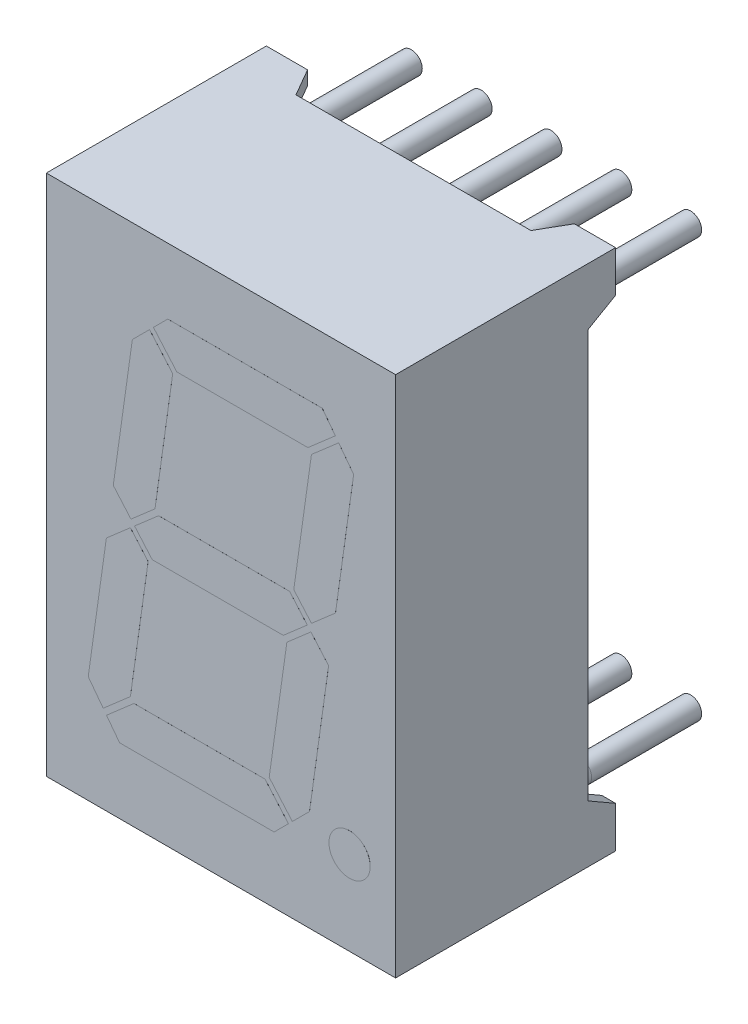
from build123d import *

# Parameters (mm, degrees)
ESBO_O1_W                   = 12.7
ESBO_O1_H                   = 19
RESSALTO_EXTRUS_O1_DEPTH    = 8
ESBO_O2_R                   = 0.75
RESSALTO_EXTRUS_O2_DEPTH    = 0.001
ESBO_O6_W                   = 11.7
ESBO_O6_H                   = 18
CORTE_EXTRUS_O3_DEPTH       = 1
CORTE_EXTRUS_O1_DEPTH       = 6.35
CORTE_EXTRUS_O2_DEPTH       = 9.5
ESBO_O5_R                   = 0.4
RESSALTO_EXTRUS_O3_DEPTH    = 4
RESSALTO_EXTRUS_O3_2_DEPTH  = 4
RESSALTO_EXTRUS_O3_3_DEPTH  = 4
RESSALTO_EXTRUS_O3_4_DEPTH  = 4
RESSALTO_EXTRUS_O3_5_DEPTH  = 4
RESSALTO_EXTRUS_O3_6_DEPTH  = 4
RESSALTO_EXTRUS_O3_7_DEPTH  = 4
RESSALTO_EXTRUS_O3_8_DEPTH  = 4
RESSALTO_EXTRUS_O3_9_DEPTH  = 4
RESSALTO_EXTRUS_O3_10_DEPTH = 4
ESBO_O5_2_R                 = 0.4
RESSALTO_EXTRUS_O4_DEPTH    = 2


with BuildPart() as part:
    # Esbo_o1 → Ressalto-extrus_o1 (new body)
    with BuildSketch(Plane.XY):
        Rectangle(ESBO_O1_W, ESBO_O1_H)
    extrude(amount=RESSALTO_EXTRUS_O1_DEPTH)

    # Esbo_o2 → Ressalto-extrus_o2 (add)
    with BuildSketch(Plane.XY.offset(8)):
        with Locations((4.678171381, -6.446979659)):
            Circle(ESBO_O2_R)
        Polygon((1.933191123, -7.11), (-3.685234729, -7.11), (-4.160537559, -6.47925184), (-3.160577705, -5.61), (1.603633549, -5.61), (2.454444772, -6.588746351), align=None)
        Polygon((4.281194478, 6.3191347), (4.82583005, 5.596378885), (4.165929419, 0.900941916), (3.291804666, 0.141076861), (2.648415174, 0.881211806), (3.291789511, 5.459058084), align=None)
        Polygon((3.272074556, -0.141076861), (2.397949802, -0.900941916), (1.754575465, -5.478788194), (2.596211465, -6.446979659), (3.221063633, -5.822127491), (3.915464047, -0.881211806), align=None)
        Polygon((3.14086275, 0.009865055), (2.497473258, 0.75), (-2.266737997, 0.75), (-3.14086275, -0.009865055), (-2.497473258, -0.75), (2.266737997, -0.75), align=None)
        Polygon((-1.603633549, 5.61), (3.160577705, 5.61), (4.160537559, 6.47925184), (3.685234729, 7.11), (-1.933191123, 7.11), (-2.454444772, 6.588746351), align=None)
        Polygon((-3.291789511, -5.459058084), (-2.648415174, -0.881211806), (-3.291804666, -0.141076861), (-4.165929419, -0.900941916), (-4.82583005, -5.596378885), (-4.281194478, -6.3191347), align=None)
        Polygon((-1.754575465, 5.478788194), (-2.596211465, 6.446979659), (-3.221063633, 5.822127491), (-3.915464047, 0.881211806), (-3.272074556, 0.141076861), (-2.397949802, 0.900941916), align=None)
    extrude(amount=RESSALTO_EXTRUS_O2_DEPTH)

    # Esbo_o6 → Corte-extrus_o3 (cut)
    with BuildSketch(Plane.XY):
        Rectangle(ESBO_O6_W, ESBO_O6_H)
    extrude(amount=CORTE_EXTRUS_O3_DEPTH, mode=Mode.SUBTRACT)

    # Esbo_o3 → Corte-extrus_o1 (cut, symmetric)
    with BuildSketch(Plane(origin=(0, 0, 0), x_dir=(0, 0, -1), z_dir=(1, 0, 0))):
        Polygon((0, -8), (0, 8), (-1, 7.422649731), (-1, -7.422649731), align=None)
    extrude(amount=CORTE_EXTRUS_O1_DEPTH, both=True, mode=Mode.SUBTRACT)

    # Esbo_o4 → Corte-extrus_o2 (cut, symmetric)
    with BuildSketch(Plane(origin=(0, 0, 0), x_dir=(1, 0, 0), z_dir=(0, 1, 0))):
        Polygon((4.85, 0), (-4.85, 0), (-4.272649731, -1), (4.272649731, -1), align=None)
    extrude(amount=CORTE_EXTRUS_O2_DEPTH, both=True, mode=Mode.SUBTRACT)



with BuildPart() as body_2:
    # Esbo_o5 → Ressalto-extrus_o3 (new body)
    with BuildSketch(Plane.XY):
        with Locations((0, 7.62)):
            Circle(ESBO_O5_R)
    extrude(amount=-RESSALTO_EXTRUS_O3_DEPTH)


with BuildPart() as body_3:
    # Esbo_o5 → Ressalto-extrus_o3 2 (new body)
    with BuildSketch(Plane.XY):
        with Locations((2.54, 7.62)):
            Circle(ESBO_O5_R)
    extrude(amount=-RESSALTO_EXTRUS_O3_2_DEPTH)


with BuildPart() as body_4:
    # Esbo_o5 → Ressalto-extrus_o3 3 (new body)
    with BuildSketch(Plane.XY):
        with Locations((5.08, 7.62)):
            Circle(ESBO_O5_R)
    extrude(amount=-RESSALTO_EXTRUS_O3_3_DEPTH)


with BuildPart() as body_5:
    # Esbo_o5 → Ressalto-extrus_o3 4 (new body)
    with BuildSketch(Plane.XY):
        with Locations((-2.54, 7.62)):
            Circle(ESBO_O5_R)
    extrude(amount=-RESSALTO_EXTRUS_O3_4_DEPTH)


with BuildPart() as body_6:
    # Esbo_o5 → Ressalto-extrus_o3 5 (new body)
    with BuildSketch(Plane.XY):
        with Locations((-5.08, 7.62)):
            Circle(ESBO_O5_R)
    extrude(amount=-RESSALTO_EXTRUS_O3_5_DEPTH)


with BuildPart() as body_7:
    # Esbo_o5 → Ressalto-extrus_o3 6 (new body)
    with BuildSketch(Plane.XY):
        with Locations(Location((-5.08, -7.62, 0), (0, 0, 180))):
            Circle(ESBO_O5_R)
    extrude(amount=-RESSALTO_EXTRUS_O3_6_DEPTH)


with BuildPart() as body_8:
    # Esbo_o5 → Ressalto-extrus_o3 7 (new body)
    with BuildSketch(Plane.XY):
        with Locations(Location((-2.54, -7.62, 0), (0, 0, 180))):
            Circle(ESBO_O5_R)
    extrude(amount=-RESSALTO_EXTRUS_O3_7_DEPTH)


with BuildPart() as body_9:
    # Esbo_o5 → Ressalto-extrus_o3 8 (new body)
    with BuildSketch(Plane.XY):
        with Locations(Location((5.08, -7.62, 0), (0, 0, 180))):
            Circle(ESBO_O5_R)
    extrude(amount=-RESSALTO_EXTRUS_O3_8_DEPTH)


with BuildPart() as body_10:
    # Esbo_o5 → Ressalto-extrus_o3 9 (new body)
    with BuildSketch(Plane.XY):
        with Locations(Location((2.54, -7.62, 0), (0, 0, 180))):
            Circle(ESBO_O5_R)
    extrude(amount=-RESSALTO_EXTRUS_O3_9_DEPTH)


with BuildPart() as body_11:
    # Esbo_o5 → Ressalto-extrus_o3 10 (new body)
    with BuildSketch(Plane.XY):
        with Locations(Location((0, -7.62, 0), (0, 0, 180))):
            Circle(ESBO_O5_R)
    extrude(amount=-RESSALTO_EXTRUS_O3_10_DEPTH)


with BuildPart() as part_1:
    add(part.part)

    add(body_2.part)  # Ressalto-extrus_o4 merges body 2

    add(body_3.part)  # Ressalto-extrus_o4 merges body 3

    add(body_5.part)  # Ressalto-extrus_o4 merges body 5
    # Esbo_o5_2 → Ressalto-extrus_o4 (add)
    with BuildSketch(Plane.XY):
        with Locations((0, 7.62)):
            Circle(ESBO_O5_2_R)
        with Locations((2.54, 7.62)):
            Circle(ESBO_O5_2_R)
        with Locations((5.08, 7.62)):
            Circle(ESBO_O5_2_R)
        with Locations((-2.54, 7.62)):
            Circle(ESBO_O5_2_R)
        with Locations((-5.08, 7.62)):
            Circle(ESBO_O5_2_R)
        with Locations(Location((-5.08, -7.62, 0), (0, 0, 180))):
            Circle(ESBO_O5_2_R)
        with Locations(Location((-2.54, -7.62, 0), (0, 0, 180))):
            Circle(ESBO_O5_2_R)
        with Locations(Location((5.08, -7.62, 0), (0, 0, 180))):
            Circle(ESBO_O5_2_R)
        with Locations(Location((2.54, -7.62, 0), (0, 0, 180))):
            Circle(ESBO_O5_2_R)
        with Locations(Location((0, -7.62, 0), (0, 0, 180))):
            Circle(ESBO_O5_2_R)
    extrude(amount=RESSALTO_EXTRUS_O4_DEPTH)


solid = Compound([body_4.part, body_6.part, body_7.part, body_8.part, body_9.part, body_10.part, body_11.part, part_1.part])
